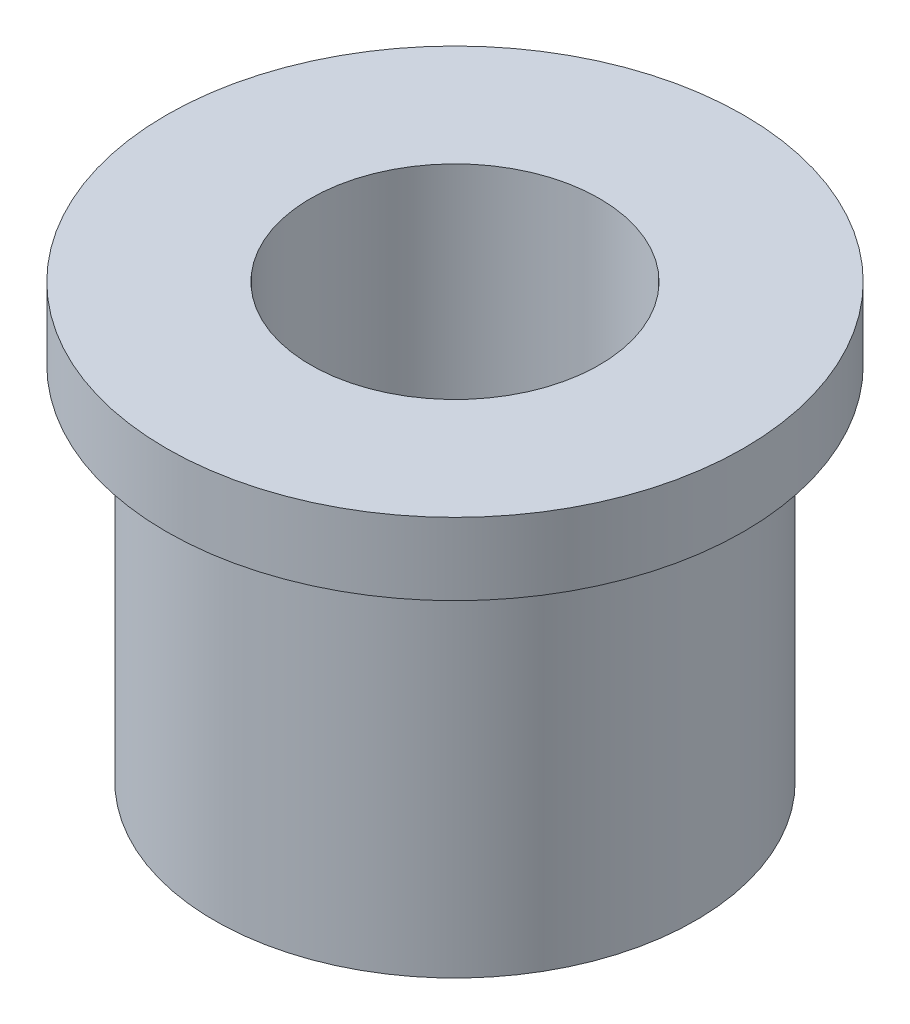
ISO-10303-21;
HEADER;
FILE_DESCRIPTION(('STEP AP214'),'2;1');
FILE_NAME('part.step','',(''),(''),'','','');
FILE_SCHEMA(('AUTOMOTIVE_DESIGN { 1 0 10303 214 1 1 1 1 }'));
ENDSEC;
DATA;
#1=APPLICATION_CONTEXT('core data for automotive mechanical design processes');
#2=APPLICATION_PROTOCOL_DEFINITION('international standard','automotive_design',2000,#1);
#3=PRODUCT_CONTEXT('',#1,'mechanical');
#4=PRODUCT('Part','Part','',(#3));
#5=PRODUCT_RELATED_PRODUCT_CATEGORY('part','',(#4));
#6=PRODUCT_DEFINITION_FORMATION('','',#4);
#7=PRODUCT_DEFINITION_CONTEXT('part definition',#1,'design');
#8=PRODUCT_DEFINITION('design','',#6,#7);
#9=PRODUCT_DEFINITION_SHAPE('','',#8);
#10=(LENGTH_UNIT() NAMED_UNIT(*) SI_UNIT(.MILLI.,.METRE.));
#11=(NAMED_UNIT(*) PLANE_ANGLE_UNIT() SI_UNIT($,.RADIAN.));
#12=(NAMED_UNIT(*) SI_UNIT($,.STERADIAN.) SOLID_ANGLE_UNIT());
#13=UNCERTAINTY_MEASURE_WITH_UNIT(LENGTH_MEASURE(1.E-05),#10,'distance_accuracy_value','');
#14=(GEOMETRIC_REPRESENTATION_CONTEXT(3) GLOBAL_UNCERTAINTY_ASSIGNED_CONTEXT((#13)) GLOBAL_UNIT_ASSIGNED_CONTEXT((#10,
#11,#12)) REPRESENTATION_CONTEXT('',''));
#15=CARTESIAN_POINT('',(0.,0.,0.));
#16=DIRECTION('',(0.,0.,1.));
#17=DIRECTION('',(1.,0.,0.));
#18=AXIS2_PLACEMENT_3D('',#15,#16,#17);
#19=CARTESIAN_POINT('',(6.,18.,0.));
#20=DIRECTION('',(0.,1.,0.));
#21=DIRECTION('',(0.,0.,1.));
#22=AXIS2_PLACEMENT_3D('',#19,#20,#21);
#23=PLANE('',#22);
#24=CARTESIAN_POINT('',(0.,18.,0.));
#25=DIRECTION('',(0.,-1.,0.));
#26=DIRECTION('',(0.,0.,-1.));
#27=AXIS2_PLACEMENT_3D('',#24,#25,#26);
#28=CIRCLE('',#27,12.);
#29=CARTESIAN_POINT('',(0.,18.,-12.));
#30=VERTEX_POINT('',#29);
#31=EDGE_CURVE('E35',#30,#30,#28,.T.);
#32=ORIENTED_EDGE('',*,*,#31,.F.);
#33=EDGE_LOOP('',(#32));
#34=FACE_BOUND('',#33,.T.);
#35=CARTESIAN_POINT('',(0.,18.,0.));
#36=DIRECTION('',(0.,-1.,0.));
#37=DIRECTION('',(0.,0.,-1.));
#38=AXIS2_PLACEMENT_3D('',#35,#36,#37);
#39=CIRCLE('',#38,6.);
#40=CARTESIAN_POINT('',(0.,18.,-6.));
#41=VERTEX_POINT('',#40);
#42=EDGE_CURVE('E17',#41,#41,#39,.T.);
#43=ORIENTED_EDGE('',*,*,#42,.T.);
#44=EDGE_LOOP('',(#43));
#45=FACE_BOUND('',#44,.T.);
#46=ADVANCED_FACE('F14',(#34,#45),#23,.T.);
#47=CARTESIAN_POINT('',(0.,0.,0.));
#48=DIRECTION('',(0.,-1.,0.));
#49=DIRECTION('',(0.,0.,-1.));
#50=AXIS2_PLACEMENT_3D('',#47,#48,#49);
#51=CYLINDRICAL_SURFACE('',#50,6.);
#52=ORIENTED_EDGE('',*,*,#42,.F.);
#53=EDGE_LOOP('',(#52));
#54=FACE_BOUND('',#53,.T.);
#55=CARTESIAN_POINT('',(0.,1.99999999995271,0.));
#56=DIRECTION('',(0.,-1.,0.));
#57=DIRECTION('',(0.,0.,-1.));
#58=AXIS2_PLACEMENT_3D('',#55,#56,#57);
#59=CIRCLE('',#58,6.00000000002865);
#60=CARTESIAN_POINT('',(0.,1.99999999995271,-6.00000000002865));
#61=VERTEX_POINT('',#60);
#62=EDGE_CURVE('E29',#61,#61,#59,.T.);
#63=ORIENTED_EDGE('',*,*,#62,.T.);
#64=EDGE_LOOP('',(#63));
#65=FACE_BOUND('',#64,.T.);
#66=ADVANCED_FACE('F44',(#54,#65),#51,.F.);
#67=CARTESIAN_POINT('',(0.,0.,0.));
#68=DIRECTION('',(0.,-1.,0.));
#69=DIRECTION('',(0.,0.,-1.));
#70=AXIS2_PLACEMENT_3D('',#67,#68,#69);
#71=CYLINDRICAL_SURFACE('',#70,12.);
#72=ORIENTED_EDGE('',*,*,#31,.T.);
#73=EDGE_LOOP('',(#72));
#74=FACE_BOUND('',#73,.T.);
#75=CARTESIAN_POINT('',(0.,15.,0.));
#76=DIRECTION('',(0.,-1.,0.));
#77=DIRECTION('',(0.,0.,-1.));
#78=AXIS2_PLACEMENT_3D('',#75,#76,#77);
#79=CIRCLE('',#78,12.);
#80=CARTESIAN_POINT('',(0.,15.,-12.));
#81=VERTEX_POINT('',#80);
#82=EDGE_CURVE('E33',#81,#81,#79,.T.);
#83=ORIENTED_EDGE('',*,*,#82,.F.);
#84=EDGE_LOOP('',(#83));
#85=FACE_BOUND('',#84,.T.);
#86=ADVANCED_FACE('F47',(#74,#85),#71,.T.);
#87=CARTESIAN_POINT('',(0.,0.,0.));
#88=DIRECTION('',(0.,-1.,0.));
#89=DIRECTION('',(0.,0.,-1.));
#90=AXIS2_PLACEMENT_3D('',#87,#88,#89);
#91=CONICAL_SURFACE('',#90,7.99999999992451,0.785398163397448);
#92=ORIENTED_EDGE('',*,*,#62,.F.);
#93=EDGE_LOOP('',(#92));
#94=FACE_BOUND('',#93,.T.);
#95=CARTESIAN_POINT('',(0.,-5.6843418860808E-11,0.));
#96=DIRECTION('',(0.,-1.,0.));
#97=DIRECTION('',(0.,0.,-1.));
#98=AXIS2_PLACEMENT_3D('',#95,#96,#97);
#99=CIRCLE('',#98,7.99999999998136);
#100=CARTESIAN_POINT('',(0.,-5.6843418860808E-11,-7.99999999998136));
#101=VERTEX_POINT('',#100);
#102=EDGE_CURVE('E26',#101,#101,#99,.F.);
#103=ORIENTED_EDGE('',*,*,#102,.F.);
#104=EDGE_LOOP('',(#103));
#105=FACE_BOUND('',#104,.T.);
#106=ADVANCED_FACE('F50',(#94,#105),#91,.F.);
#107=CARTESIAN_POINT('',(12.,15.,0.));
#108=DIRECTION('',(0.,-1.,0.));
#109=DIRECTION('',(0.,0.,-1.));
#110=AXIS2_PLACEMENT_3D('',#107,#108,#109);
#111=PLANE('',#110);
#112=CARTESIAN_POINT('',(0.,15.,0.));
#113=DIRECTION('',(0.,-1.,0.));
#114=DIRECTION('',(0.,0.,-1.));
#115=AXIS2_PLACEMENT_3D('',#112,#113,#114);
#116=CIRCLE('',#115,10.);
#117=CARTESIAN_POINT('',(0.,15.,-10.));
#118=VERTEX_POINT('',#117);
#119=EDGE_CURVE('E21',#118,#118,#116,.T.);
#120=ORIENTED_EDGE('',*,*,#119,.F.);
#121=EDGE_LOOP('',(#120));
#122=FACE_BOUND('',#121,.T.);
#123=ORIENTED_EDGE('',*,*,#82,.T.);
#124=EDGE_LOOP('',(#123));
#125=FACE_BOUND('',#124,.T.);
#126=ADVANCED_FACE('F53',(#122,#125),#111,.T.);
#127=CARTESIAN_POINT('',(10.,0.,0.));
#128=DIRECTION('',(0.,-1.,0.));
#129=DIRECTION('',(0.,0.,-1.));
#130=AXIS2_PLACEMENT_3D('',#127,#128,#129);
#131=PLANE('',#130);
#132=CARTESIAN_POINT('',(0.,0.,0.));
#133=DIRECTION('',(0.,-1.,0.));
#134=DIRECTION('',(0.,0.,-1.));
#135=AXIS2_PLACEMENT_3D('',#132,#133,#134);
#136=CIRCLE('',#135,10.);
#137=CARTESIAN_POINT('',(0.,0.,-10.));
#138=VERTEX_POINT('',#137);
#139=EDGE_CURVE('E10',#138,#138,#136,.F.);
#140=ORIENTED_EDGE('',*,*,#139,.F.);
#141=EDGE_LOOP('',(#140));
#142=FACE_BOUND('',#141,.T.);
#143=ORIENTED_EDGE('',*,*,#102,.T.);
#144=EDGE_LOOP('',(#143));
#145=FACE_BOUND('',#144,.T.);
#146=ADVANCED_FACE('F57',(#142,#145),#131,.T.);
#147=CARTESIAN_POINT('',(0.,0.,0.));
#148=DIRECTION('',(0.,-1.,0.));
#149=DIRECTION('',(0.,0.,-1.));
#150=AXIS2_PLACEMENT_3D('',#147,#148,#149);
#151=CYLINDRICAL_SURFACE('',#150,10.);
#152=ORIENTED_EDGE('',*,*,#139,.T.);
#153=EDGE_LOOP('',(#152));
#154=FACE_BOUND('',#153,.T.);
#155=ORIENTED_EDGE('',*,*,#119,.T.);
#156=EDGE_LOOP('',(#155));
#157=FACE_BOUND('',#156,.T.);
#158=ADVANCED_FACE('F59',(#154,#157),#151,.T.);
#159=CLOSED_SHELL('',(#46,#66,#86,#106,#126,#146,#158));
#160=MANIFOLD_SOLID_BREP('B1',#159);
#161=ADVANCED_BREP_SHAPE_REPRESENTATION('',(#18,#160),#14);
#162=SHAPE_DEFINITION_REPRESENTATION(#9,#161);
ENDSEC;
END-ISO-10303-21;
